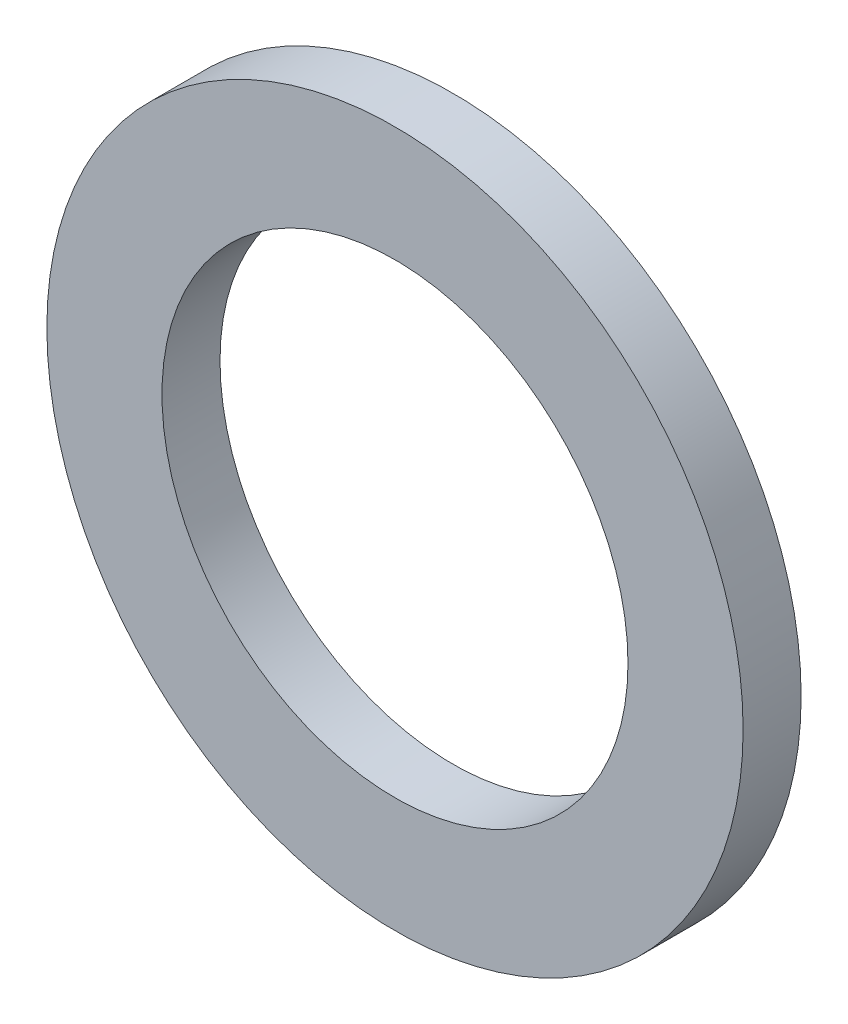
ISO-10303-21;
HEADER;
FILE_DESCRIPTION(('STEP AP214'),'2;1');
FILE_NAME('part.step','',(''),(''),'','','');
FILE_SCHEMA(('AUTOMOTIVE_DESIGN { 1 0 10303 214 1 1 1 1 }'));
ENDSEC;
DATA;
#1=APPLICATION_CONTEXT('core data for automotive mechanical design processes');
#2=APPLICATION_PROTOCOL_DEFINITION('international standard','automotive_design',2000,#1);
#3=PRODUCT_CONTEXT('',#1,'mechanical');
#4=PRODUCT('Part','Part','',(#3));
#5=PRODUCT_RELATED_PRODUCT_CATEGORY('part','',(#4));
#6=PRODUCT_DEFINITION_FORMATION('','',#4);
#7=PRODUCT_DEFINITION_CONTEXT('part definition',#1,'design');
#8=PRODUCT_DEFINITION('design','',#6,#7);
#9=PRODUCT_DEFINITION_SHAPE('','',#8);
#10=(LENGTH_UNIT() NAMED_UNIT(*) SI_UNIT(.MILLI.,.METRE.));
#11=(NAMED_UNIT(*) PLANE_ANGLE_UNIT() SI_UNIT($,.RADIAN.));
#12=(NAMED_UNIT(*) SI_UNIT($,.STERADIAN.) SOLID_ANGLE_UNIT());
#13=UNCERTAINTY_MEASURE_WITH_UNIT(LENGTH_MEASURE(1.E-05),#10,'distance_accuracy_value','');
#14=(GEOMETRIC_REPRESENTATION_CONTEXT(3) GLOBAL_UNCERTAINTY_ASSIGNED_CONTEXT((#13)) GLOBAL_UNIT_ASSIGNED_CONTEXT((#10,
#11,#12)) REPRESENTATION_CONTEXT('',''));
#15=CARTESIAN_POINT('',(0.,0.,0.));
#16=DIRECTION('',(0.,0.,1.));
#17=DIRECTION('',(1.,0.,0.));
#18=AXIS2_PLACEMENT_3D('',#15,#16,#17);
#19=CARTESIAN_POINT('',(0.,0.,1.27));
#20=DIRECTION('',(0.,0.,1.));
#21=DIRECTION('',(1.,0.,0.));
#22=AXIS2_PLACEMENT_3D('',#19,#20,#21);
#23=PLANE('',#22);
#24=CARTESIAN_POINT('',(0.,0.,1.27));
#25=DIRECTION('',(0.,0.,1.));
#26=DIRECTION('',(1.,0.,0.));
#27=AXIS2_PLACEMENT_3D('',#24,#25,#26);
#28=CIRCLE('',#27,5.1);
#29=CARTESIAN_POINT('',(5.1,0.,1.27));
#30=VERTEX_POINT('',#29);
#31=EDGE_CURVE('E26',#30,#30,#28,.T.);
#32=ORIENTED_EDGE('',*,*,#31,.F.);
#33=EDGE_LOOP('',(#32));
#34=FACE_BOUND('',#33,.T.);
#35=CARTESIAN_POINT('',(0.,0.,1.27));
#36=DIRECTION('',(0.,0.,-1.));
#37=DIRECTION('',(-1.,0.,0.));
#38=AXIS2_PLACEMENT_3D('',#35,#36,#37);
#39=CIRCLE('',#38,7.62);
#40=CARTESIAN_POINT('',(-7.62,0.,1.27));
#41=VERTEX_POINT('',#40);
#42=EDGE_CURVE('E8',#41,#41,#39,.T.);
#43=ORIENTED_EDGE('',*,*,#42,.F.);
#44=EDGE_LOOP('',(#43));
#45=FACE_BOUND('',#44,.T.);
#46=ADVANCED_FACE('F12',(#34,#45),#23,.T.);
#47=CARTESIAN_POINT('',(0.,0.,0.));
#48=DIRECTION('',(0.,0.,-1.));
#49=DIRECTION('',(-1.,0.,0.));
#50=AXIS2_PLACEMENT_3D('',#47,#48,#49);
#51=PLANE('',#50);
#52=CARTESIAN_POINT('',(0.,0.,0.));
#53=DIRECTION('',(0.,0.,-1.));
#54=DIRECTION('',(-1.,0.,0.));
#55=AXIS2_PLACEMENT_3D('',#52,#53,#54);
#56=CIRCLE('',#55,5.1);
#57=CARTESIAN_POINT('',(-5.1,0.,0.));
#58=VERTEX_POINT('',#57);
#59=EDGE_CURVE('E16',#58,#58,#56,.T.);
#60=ORIENTED_EDGE('',*,*,#59,.F.);
#61=EDGE_LOOP('',(#60));
#62=FACE_BOUND('',#61,.T.);
#63=CARTESIAN_POINT('',(0.,0.,0.));
#64=DIRECTION('',(0.,0.,1.));
#65=DIRECTION('',(1.,0.,0.));
#66=AXIS2_PLACEMENT_3D('',#63,#64,#65);
#67=CIRCLE('',#66,7.62);
#68=CARTESIAN_POINT('',(7.62,0.,0.));
#69=VERTEX_POINT('',#68);
#70=EDGE_CURVE('E20',#69,#69,#67,.T.);
#71=ORIENTED_EDGE('',*,*,#70,.F.);
#72=EDGE_LOOP('',(#71));
#73=FACE_BOUND('',#72,.T.);
#74=ADVANCED_FACE('F35',(#62,#73),#51,.T.);
#75=CARTESIAN_POINT('',(0.,0.,0.));
#76=DIRECTION('',(0.,0.,1.));
#77=DIRECTION('',(1.,0.,0.));
#78=AXIS2_PLACEMENT_3D('',#75,#76,#77);
#79=CYLINDRICAL_SURFACE('',#78,7.62);
#80=ORIENTED_EDGE('',*,*,#42,.T.);
#81=EDGE_LOOP('',(#80));
#82=FACE_BOUND('',#81,.T.);
#83=ORIENTED_EDGE('',*,*,#70,.T.);
#84=EDGE_LOOP('',(#83));
#85=FACE_BOUND('',#84,.T.);
#86=ADVANCED_FACE('F14',(#82,#85),#79,.T.);
#87=CARTESIAN_POINT('',(0.,0.,-8.73));
#88=DIRECTION('',(0.,0.,1.));
#89=DIRECTION('',(1.,0.,0.));
#90=AXIS2_PLACEMENT_3D('',#87,#88,#89);
#91=CYLINDRICAL_SURFACE('',#90,5.1);
#92=ORIENTED_EDGE('',*,*,#59,.T.);
#93=EDGE_LOOP('',(#92));
#94=FACE_BOUND('',#93,.T.);
#95=ORIENTED_EDGE('',*,*,#31,.T.);
#96=EDGE_LOOP('',(#95));
#97=FACE_BOUND('',#96,.T.);
#98=ADVANCED_FACE('F33',(#94,#97),#91,.F.);
#99=CLOSED_SHELL('',(#46,#74,#86,#98));
#100=MANIFOLD_SOLID_BREP('B1',#99);
#101=ADVANCED_BREP_SHAPE_REPRESENTATION('',(#18,#100),#14);
#102=SHAPE_DEFINITION_REPRESENTATION(#9,#101);
ENDSEC;
END-ISO-10303-21;
